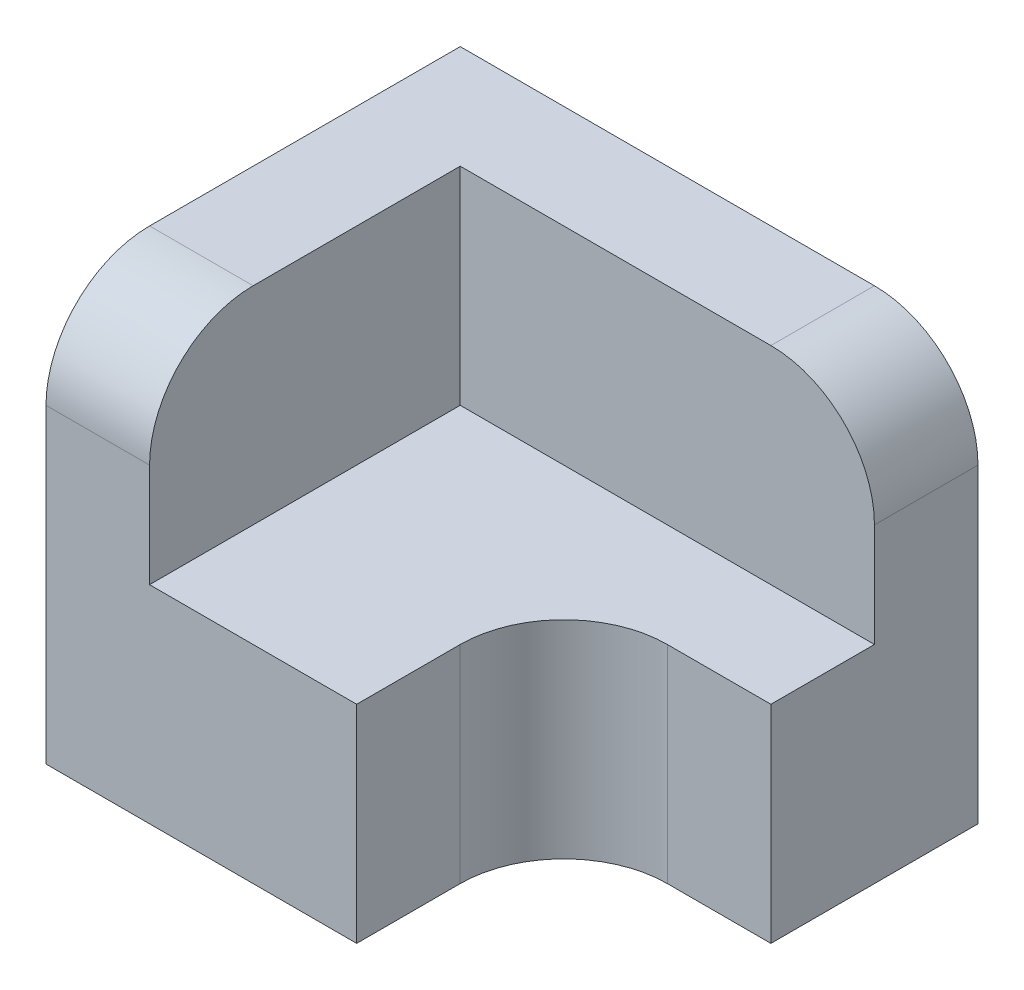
from build123d import *

# Parameters (mm, degrees)
EXTRUDE1_DEPTH      = 20
EXTRUDE_THIN1_DEPTH = 20
FILLET1_R           = 10


with BuildPart() as part:
    # Sketch1 → Extrude1 (new body)
    with BuildSketch(Plane(origin=(0, 0, 0), x_dir=(1, 0, 0), z_dir=(0, 1, 0))):
        Polygon((50, 20), (30, 20), (30, 0), (0, 0), (0, 40), (50, 40), align=None)
    extrude(amount=EXTRUDE1_DEPTH)

    # Sketch2 → Extrude-Thin1 (add)
    with BuildSketch(Plane(origin=(0, 20, 0), x_dir=(1, 0, 0), z_dir=(0, 1, 0))):
        Polygon((50, 40), (0, 40), (0, 0), (10, 0), (10, 30), (50, 30), align=None)
    extrude(amount=EXTRUDE_THIN1_DEPTH)

    # Fillet1
    fillet1_edges = [part.edges().sort_by_distance(p)[0] for p in [
        (30, 10, -20),
        (50, 40, -35),
        (5, 40, 0),
    ]]
    fillet(fillet1_edges, radius=FILLET1_R)


solid = part.part
